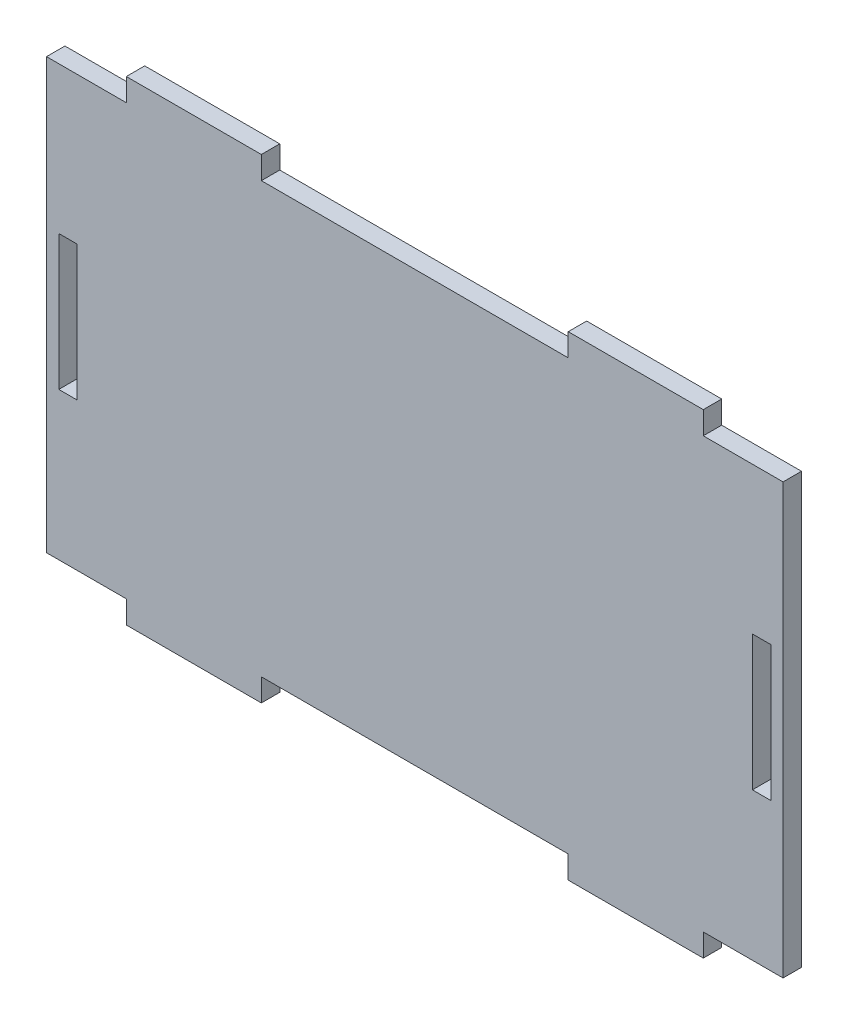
ISO-10303-21;
HEADER;
FILE_DESCRIPTION(('STEP AP214'),'2;1');
FILE_NAME('part.step','',(''),(''),'','','');
FILE_SCHEMA(('AUTOMOTIVE_DESIGN { 1 0 10303 214 1 1 1 1 }'));
ENDSEC;
DATA;
#1=APPLICATION_CONTEXT('core data for automotive mechanical design processes');
#2=APPLICATION_PROTOCOL_DEFINITION('international standard','automotive_design',2000,#1);
#3=PRODUCT_CONTEXT('',#1,'mechanical');
#4=PRODUCT('Part','Part','',(#3));
#5=PRODUCT_RELATED_PRODUCT_CATEGORY('part','',(#4));
#6=PRODUCT_DEFINITION_FORMATION('','',#4);
#7=PRODUCT_DEFINITION_CONTEXT('part definition',#1,'design');
#8=PRODUCT_DEFINITION('design','',#6,#7);
#9=PRODUCT_DEFINITION_SHAPE('','',#8);
#10=(LENGTH_UNIT() NAMED_UNIT(*) SI_UNIT(.MILLI.,.METRE.));
#11=(NAMED_UNIT(*) PLANE_ANGLE_UNIT() SI_UNIT($,.RADIAN.));
#12=(NAMED_UNIT(*) SI_UNIT($,.STERADIAN.) SOLID_ANGLE_UNIT());
#13=UNCERTAINTY_MEASURE_WITH_UNIT(LENGTH_MEASURE(1.E-05),#10,'distance_accuracy_value','');
#14=(GEOMETRIC_REPRESENTATION_CONTEXT(3) GLOBAL_UNCERTAINTY_ASSIGNED_CONTEXT((#13)) GLOBAL_UNIT_ASSIGNED_CONTEXT((#10,
#11,#12)) REPRESENTATION_CONTEXT('',''));
#15=CARTESIAN_POINT('',(0.,0.,0.));
#16=DIRECTION('',(0.,0.,1.));
#17=DIRECTION('',(1.,0.,0.));
#18=AXIS2_PLACEMENT_3D('',#15,#16,#17);
#19=CARTESIAN_POINT('',(118.,0.,3.));
#20=DIRECTION('',(1.,0.,0.));
#21=DIRECTION('',(0.,1.,0.));
#22=AXIS2_PLACEMENT_3D('',#19,#20,#21);
#23=PLANE('',#22);
#24=DIRECTION('',(0.,-1.,0.));
#25=VECTOR('',#24,1.);
#26=CARTESIAN_POINT('',(118.,0.,0.));
#27=LINE('',#26,#25);
#28=CARTESIAN_POINT('',(118.,46.0461461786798,0.));
#29=VERTEX_POINT('',#28);
#30=CARTESIAN_POINT('',(118.,24.0461461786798,0.));
#31=VERTEX_POINT('',#30);
#32=EDGE_CURVE('E318',#29,#31,#27,.T.);
#33=ORIENTED_EDGE('',*,*,#32,.T.);
#34=DIRECTION('',(0.,0.,-1.));
#35=VECTOR('',#34,1.);
#36=CARTESIAN_POINT('',(118.,24.0461461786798,3.));
#37=LINE('',#36,#35);
#38=CARTESIAN_POINT('',(118.,24.0461461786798,3.));
#39=VERTEX_POINT('',#38);
#40=EDGE_CURVE('E11',#39,#31,#37,.T.);
#41=ORIENTED_EDGE('',*,*,#40,.F.);
#42=DIRECTION('',(0.,-1.,0.));
#43=VECTOR('',#42,1.);
#44=CARTESIAN_POINT('',(118.,0.,3.));
#45=LINE('',#44,#43);
#46=CARTESIAN_POINT('',(118.,46.0461461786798,3.));
#47=VERTEX_POINT('',#46);
#48=EDGE_CURVE('E234',#47,#39,#45,.T.);
#49=ORIENTED_EDGE('',*,*,#48,.F.);
#50=DIRECTION('',(0.,0.,-1.));
#51=VECTOR('',#50,1.);
#52=CARTESIAN_POINT('',(118.,46.0461461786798,3.));
#53=LINE('',#52,#51);
#54=EDGE_CURVE('E54',#47,#29,#53,.T.);
#55=ORIENTED_EDGE('',*,*,#54,.T.);
#56=EDGE_LOOP('',(#33,#41,#49,#55));
#57=FACE_BOUND('',#56,.T.);
#58=ADVANCED_FACE('F35',(#57),#23,.F.);
#59=CARTESIAN_POINT('',(0.,24.0461461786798,3.));
#60=DIRECTION('',(0.,-1.,0.));
#61=DIRECTION('',(0.,0.,-1.));
#62=AXIS2_PLACEMENT_3D('',#59,#60,#61);
#63=PLANE('',#62);
#64=DIRECTION('',(-1.,0.,0.));
#65=VECTOR('',#64,1.);
#66=CARTESIAN_POINT('',(0.,24.0461461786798,0.));
#67=LINE('',#66,#65);
#68=CARTESIAN_POINT('',(115.,24.0461461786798,0.));
#69=VERTEX_POINT('',#68);
#70=EDGE_CURVE('E240',#31,#69,#67,.T.);
#71=ORIENTED_EDGE('',*,*,#70,.T.);
#72=DIRECTION('',(0.,0.,-1.));
#73=VECTOR('',#72,1.);
#74=CARTESIAN_POINT('',(115.,24.0461461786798,3.));
#75=LINE('',#74,#73);
#76=CARTESIAN_POINT('',(115.,24.0461461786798,3.));
#77=VERTEX_POINT('',#76);
#78=EDGE_CURVE('E45',#77,#69,#75,.T.);
#79=ORIENTED_EDGE('',*,*,#78,.F.);
#80=DIRECTION('',(-1.,0.,0.));
#81=VECTOR('',#80,1.);
#82=CARTESIAN_POINT('',(0.,24.0461461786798,3.));
#83=LINE('',#82,#81);
#84=EDGE_CURVE('E228',#39,#77,#83,.T.);
#85=ORIENTED_EDGE('',*,*,#84,.F.);
#86=ORIENTED_EDGE('',*,*,#40,.T.);
#87=EDGE_LOOP('',(#71,#79,#85,#86));
#88=FACE_BOUND('',#87,.T.);
#89=ADVANCED_FACE('F239',(#88),#63,.F.);
#90=CARTESIAN_POINT('',(115.,0.,3.));
#91=DIRECTION('',(1.,0.,0.));
#92=DIRECTION('',(0.,1.,0.));
#93=AXIS2_PLACEMENT_3D('',#90,#91,#92);
#94=PLANE('',#93);
#95=DIRECTION('',(0.,-1.,0.));
#96=VECTOR('',#95,1.);
#97=CARTESIAN_POINT('',(115.,0.,0.));
#98=LINE('',#97,#96);
#99=CARTESIAN_POINT('',(115.,46.0461461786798,0.));
#100=VERTEX_POINT('',#99);
#101=EDGE_CURVE('E321',#100,#69,#98,.T.);
#102=ORIENTED_EDGE('',*,*,#101,.F.);
#103=DIRECTION('',(0.,0.,-1.));
#104=VECTOR('',#103,1.);
#105=CARTESIAN_POINT('',(115.,46.0461461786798,3.));
#106=LINE('',#105,#104);
#107=CARTESIAN_POINT('',(115.,46.0461461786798,3.));
#108=VERTEX_POINT('',#107);
#109=EDGE_CURVE('E140',#108,#100,#106,.T.);
#110=ORIENTED_EDGE('',*,*,#109,.F.);
#111=DIRECTION('',(0.,-1.,0.));
#112=VECTOR('',#111,1.);
#113=CARTESIAN_POINT('',(115.,0.,3.));
#114=LINE('',#113,#112);
#115=EDGE_CURVE('E233',#108,#77,#114,.T.);
#116=ORIENTED_EDGE('',*,*,#115,.T.);
#117=ORIENTED_EDGE('',*,*,#78,.T.);
#118=EDGE_LOOP('',(#102,#110,#116,#117));
#119=FACE_BOUND('',#118,.T.);
#120=ADVANCED_FACE('F244',(#119),#94,.T.);
#121=CARTESIAN_POINT('',(0.,46.0461461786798,3.));
#122=DIRECTION('',(0.,1.,0.));
#123=DIRECTION('',(0.,0.,1.));
#124=AXIS2_PLACEMENT_3D('',#121,#122,#123);
#125=PLANE('',#124);
#126=DIRECTION('',(1.,0.,0.));
#127=VECTOR('',#126,1.);
#128=CARTESIAN_POINT('',(0.,46.0461461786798,0.));
#129=LINE('',#128,#127);
#130=CARTESIAN_POINT('',(2.,46.0461461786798,0.));
#131=VERTEX_POINT('',#130);
#132=CARTESIAN_POINT('',(5.,46.0461461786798,0.));
#133=VERTEX_POINT('',#132);
#134=EDGE_CURVE('E306',#131,#133,#129,.T.);
#135=ORIENTED_EDGE('',*,*,#134,.T.);
#136=DIRECTION('',(0.,0.,-1.));
#137=VECTOR('',#136,1.);
#138=CARTESIAN_POINT('',(5.,46.0461461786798,3.));
#139=LINE('',#138,#137);
#140=CARTESIAN_POINT('',(5.,46.0461461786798,3.));
#141=VERTEX_POINT('',#140);
#142=EDGE_CURVE('E328',#141,#133,#139,.T.);
#143=ORIENTED_EDGE('',*,*,#142,.F.);
#144=DIRECTION('',(1.,0.,0.));
#145=VECTOR('',#144,1.);
#146=CARTESIAN_POINT('',(0.,46.0461461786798,3.));
#147=LINE('',#146,#145);
#148=CARTESIAN_POINT('',(2.,46.0461461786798,3.));
#149=VERTEX_POINT('',#148);
#150=EDGE_CURVE('E748',#149,#141,#147,.T.);
#151=ORIENTED_EDGE('',*,*,#150,.F.);
#152=DIRECTION('',(0.,0.,-1.));
#153=VECTOR('',#152,1.);
#154=CARTESIAN_POINT('',(2.,46.0461461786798,3.));
#155=LINE('',#154,#153);
#156=EDGE_CURVE('E330',#149,#131,#155,.T.);
#157=ORIENTED_EDGE('',*,*,#156,.T.);
#158=EDGE_LOOP('',(#135,#143,#151,#157));
#159=FACE_BOUND('',#158,.T.);
#160=ADVANCED_FACE('F516',(#159),#125,.F.);
#161=CARTESIAN_POINT('',(5.,0.,3.));
#162=DIRECTION('',(1.,0.,0.));
#163=DIRECTION('',(0.,1.,0.));
#164=AXIS2_PLACEMENT_3D('',#161,#162,#163);
#165=PLANE('',#164);
#166=DIRECTION('',(0.,-1.,0.));
#167=VECTOR('',#166,1.);
#168=CARTESIAN_POINT('',(5.,0.,0.));
#169=LINE('',#168,#167);
#170=CARTESIAN_POINT('',(5.,24.0461461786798,0.));
#171=VERTEX_POINT('',#170);
#172=EDGE_CURVE('E309',#133,#171,#169,.T.);
#173=ORIENTED_EDGE('',*,*,#172,.T.);
#174=DIRECTION('',(0.,0.,-1.));
#175=VECTOR('',#174,1.);
#176=CARTESIAN_POINT('',(5.,24.0461461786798,3.));
#177=LINE('',#176,#175);
#178=CARTESIAN_POINT('',(5.,24.0461461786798,3.));
#179=VERTEX_POINT('',#178);
#180=EDGE_CURVE('E334',#179,#171,#177,.T.);
#181=ORIENTED_EDGE('',*,*,#180,.F.);
#182=DIRECTION('',(0.,-1.,0.));
#183=VECTOR('',#182,1.);
#184=CARTESIAN_POINT('',(5.,0.,3.));
#185=LINE('',#184,#183);
#186=EDGE_CURVE('E751',#141,#179,#185,.T.);
#187=ORIENTED_EDGE('',*,*,#186,.F.);
#188=ORIENTED_EDGE('',*,*,#142,.T.);
#189=EDGE_LOOP('',(#173,#181,#187,#188));
#190=FACE_BOUND('',#189,.T.);
#191=ADVANCED_FACE('F512',(#190),#165,.F.);
#192=CARTESIAN_POINT('',(0.,24.0461461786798,3.));
#193=DIRECTION('',(0.,1.,0.));
#194=DIRECTION('',(0.,0.,1.));
#195=AXIS2_PLACEMENT_3D('',#192,#193,#194);
#196=PLANE('',#195);
#197=DIRECTION('',(1.,0.,0.));
#198=VECTOR('',#197,1.);
#199=CARTESIAN_POINT('',(0.,24.0461461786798,0.));
#200=LINE('',#199,#198);
#201=CARTESIAN_POINT('',(2.,24.0461461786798,0.));
#202=VERTEX_POINT('',#201);
#203=EDGE_CURVE('E312',#202,#171,#200,.T.);
#204=ORIENTED_EDGE('',*,*,#203,.F.);
#205=DIRECTION('',(0.,0.,-1.));
#206=VECTOR('',#205,1.);
#207=CARTESIAN_POINT('',(2.,24.0461461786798,3.));
#208=LINE('',#207,#206);
#209=CARTESIAN_POINT('',(2.,24.0461461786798,3.));
#210=VERTEX_POINT('',#209);
#211=EDGE_CURVE('E332',#210,#202,#208,.T.);
#212=ORIENTED_EDGE('',*,*,#211,.F.);
#213=DIRECTION('',(1.,0.,0.));
#214=VECTOR('',#213,1.);
#215=CARTESIAN_POINT('',(0.,24.0461461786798,3.));
#216=LINE('',#215,#214);
#217=EDGE_CURVE('E759',#210,#179,#216,.T.);
#218=ORIENTED_EDGE('',*,*,#217,.T.);
#219=ORIENTED_EDGE('',*,*,#180,.T.);
#220=EDGE_LOOP('',(#204,#212,#218,#219));
#221=FACE_BOUND('',#220,.T.);
#222=ADVANCED_FACE('F509',(#221),#196,.T.);
#223=CARTESIAN_POINT('',(0.,70.,3.));
#224=DIRECTION('',(0.,1.,0.));
#225=DIRECTION('',(0.,0.,1.));
#226=AXIS2_PLACEMENT_3D('',#223,#224,#225);
#227=PLANE('',#226);
#228=DIRECTION('',(1.,0.,0.));
#229=VECTOR('',#228,1.);
#230=CARTESIAN_POINT('',(0.,70.,0.));
#231=LINE('',#230,#229);
#232=CARTESIAN_POINT('',(107.,70.,0.));
#233=VERTEX_POINT('',#232);
#234=CARTESIAN_POINT('',(120.,70.,0.));
#235=VERTEX_POINT('',#234);
#236=EDGE_CURVE('E251',#233,#235,#231,.T.);
#237=ORIENTED_EDGE('',*,*,#236,.F.);
#238=DIRECTION('',(0.,0.,-1.));
#239=VECTOR('',#238,1.);
#240=CARTESIAN_POINT('',(107.,70.,3.));
#241=LINE('',#240,#239);
#242=CARTESIAN_POINT('',(107.,70.,3.));
#243=VERTEX_POINT('',#242);
#244=EDGE_CURVE('E39',#243,#233,#241,.T.);
#245=ORIENTED_EDGE('',*,*,#244,.F.);
#246=DIRECTION('',(1.,0.,0.));
#247=VECTOR('',#246,1.);
#248=CARTESIAN_POINT('',(0.,70.,3.));
#249=LINE('',#248,#247);
#250=CARTESIAN_POINT('',(120.,70.,3.));
#251=VERTEX_POINT('',#250);
#252=EDGE_CURVE('E326',#243,#251,#249,.T.);
#253=ORIENTED_EDGE('',*,*,#252,.T.);
#254=DIRECTION('',(0.,0.,-1.));
#255=VECTOR('',#254,1.);
#256=CARTESIAN_POINT('',(120.,70.,3.));
#257=LINE('',#256,#255);
#258=EDGE_CURVE('E247',#251,#235,#257,.T.);
#259=ORIENTED_EDGE('',*,*,#258,.T.);
#260=EDGE_LOOP('',(#237,#245,#253,#259));
#261=FACE_BOUND('',#260,.T.);
#262=ADVANCED_FACE('F37',(#261),#227,.T.);
#263=CARTESIAN_POINT('',(107.,0.,3.));
#264=DIRECTION('',(-1.,0.,0.));
#265=DIRECTION('',(0.,0.,1.));
#266=AXIS2_PLACEMENT_3D('',#263,#264,#265);
#267=PLANE('',#266);
#268=DIRECTION('',(0.,1.,0.));
#269=VECTOR('',#268,1.);
#270=CARTESIAN_POINT('',(107.,0.,0.));
#271=LINE('',#270,#269);
#272=CARTESIAN_POINT('',(107.,73.6959879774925,0.));
#273=VERTEX_POINT('',#272);
#274=EDGE_CURVE('E254',#233,#273,#271,.T.);
#275=ORIENTED_EDGE('',*,*,#274,.T.);
#276=DIRECTION('',(0.,0.,-1.));
#277=VECTOR('',#276,1.);
#278=CARTESIAN_POINT('',(107.,73.6959879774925,3.));
#279=LINE('',#278,#277);
#280=CARTESIAN_POINT('',(107.,73.6959879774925,3.));
#281=VERTEX_POINT('',#280);
#282=EDGE_CURVE('E377',#281,#273,#279,.T.);
#283=ORIENTED_EDGE('',*,*,#282,.F.);
#284=DIRECTION('',(0.,1.,0.));
#285=VECTOR('',#284,1.);
#286=CARTESIAN_POINT('',(107.,0.,3.));
#287=LINE('',#286,#285);
#288=EDGE_CURVE('E385',#243,#281,#287,.T.);
#289=ORIENTED_EDGE('',*,*,#288,.F.);
#290=ORIENTED_EDGE('',*,*,#244,.T.);
#291=EDGE_LOOP('',(#275,#283,#289,#290));
#292=FACE_BOUND('',#291,.T.);
#293=ADVANCED_FACE('F384',(#292),#267,.F.);
#294=CARTESIAN_POINT('',(0.,73.6959879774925,3.));
#295=DIRECTION('',(0.,1.,0.));
#296=DIRECTION('',(0.,0.,1.));
#297=AXIS2_PLACEMENT_3D('',#294,#295,#296);
#298=PLANE('',#297);
#299=DIRECTION('',(1.,0.,0.));
#300=VECTOR('',#299,1.);
#301=CARTESIAN_POINT('',(0.,73.6959879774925,0.));
#302=LINE('',#301,#300);
#303=CARTESIAN_POINT('',(85.,73.6959879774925,0.));
#304=VERTEX_POINT('',#303);
#305=EDGE_CURVE('E257',#304,#273,#302,.T.);
#306=ORIENTED_EDGE('',*,*,#305,.F.);
#307=DIRECTION('',(0.,0.,-1.));
#308=VECTOR('',#307,1.);
#309=CARTESIAN_POINT('',(85.,73.6959879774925,3.));
#310=LINE('',#309,#308);
#311=CARTESIAN_POINT('',(85.,73.6959879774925,3.));
#312=VERTEX_POINT('',#311);
#313=EDGE_CURVE('E376',#312,#304,#310,.T.);
#314=ORIENTED_EDGE('',*,*,#313,.F.);
#315=DIRECTION('',(1.,0.,0.));
#316=VECTOR('',#315,1.);
#317=CARTESIAN_POINT('',(0.,73.6959879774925,3.));
#318=LINE('',#317,#316);
#319=EDGE_CURVE('E787',#312,#281,#318,.T.);
#320=ORIENTED_EDGE('',*,*,#319,.T.);
#321=ORIENTED_EDGE('',*,*,#282,.T.);
#322=EDGE_LOOP('',(#306,#314,#320,#321));
#323=FACE_BOUND('',#322,.T.);
#324=ADVANCED_FACE('F488',(#323),#298,.T.);
#325=CARTESIAN_POINT('',(85.,0.,3.));
#326=DIRECTION('',(-1.,0.,0.));
#327=DIRECTION('',(0.,0.,1.));
#328=AXIS2_PLACEMENT_3D('',#325,#326,#327);
#329=PLANE('',#328);
#330=DIRECTION('',(0.,1.,0.));
#331=VECTOR('',#330,1.);
#332=CARTESIAN_POINT('',(85.,0.,0.));
#333=LINE('',#332,#331);
#334=CARTESIAN_POINT('',(85.,70.,0.));
#335=VERTEX_POINT('',#334);
#336=EDGE_CURVE('E260',#335,#304,#333,.T.);
#337=ORIENTED_EDGE('',*,*,#336,.F.);
#338=DIRECTION('',(0.,0.,-1.));
#339=VECTOR('',#338,1.);
#340=CARTESIAN_POINT('',(85.,70.,3.));
#341=LINE('',#340,#339);
#342=CARTESIAN_POINT('',(85.,70.,3.));
#343=VERTEX_POINT('',#342);
#344=EDGE_CURVE('E374',#343,#335,#341,.T.);
#345=ORIENTED_EDGE('',*,*,#344,.F.);
#346=DIRECTION('',(0.,1.,0.));
#347=VECTOR('',#346,1.);
#348=CARTESIAN_POINT('',(85.,0.,3.));
#349=LINE('',#348,#347);
#350=EDGE_CURVE('E486',#343,#312,#349,.T.);
#351=ORIENTED_EDGE('',*,*,#350,.T.);
#352=ORIENTED_EDGE('',*,*,#313,.T.);
#353=EDGE_LOOP('',(#337,#345,#351,#352));
#354=FACE_BOUND('',#353,.T.);
#355=ADVANCED_FACE('F485',(#354),#329,.T.);
#356=CARTESIAN_POINT('',(0.,70.,3.));
#357=DIRECTION('',(0.,1.,0.));
#358=DIRECTION('',(0.,0.,1.));
#359=AXIS2_PLACEMENT_3D('',#356,#357,#358);
#360=PLANE('',#359);
#361=DIRECTION('',(1.,0.,0.));
#362=VECTOR('',#361,1.);
#363=CARTESIAN_POINT('',(0.,70.,0.));
#364=LINE('',#363,#362);
#365=CARTESIAN_POINT('',(35.,70.,0.));
#366=VERTEX_POINT('',#365);
#367=EDGE_CURVE('E263',#366,#335,#364,.T.);
#368=ORIENTED_EDGE('',*,*,#367,.F.);
#369=DIRECTION('',(0.,0.,-1.));
#370=VECTOR('',#369,1.);
#371=CARTESIAN_POINT('',(35.,70.,3.));
#372=LINE('',#371,#370);
#373=CARTESIAN_POINT('',(35.,70.,3.));
#374=VERTEX_POINT('',#373);
#375=EDGE_CURVE('E372',#374,#366,#372,.T.);
#376=ORIENTED_EDGE('',*,*,#375,.F.);
#377=DIRECTION('',(1.,0.,0.));
#378=VECTOR('',#377,1.);
#379=CARTESIAN_POINT('',(0.,70.,3.));
#380=LINE('',#379,#378);
#381=EDGE_CURVE('E481',#374,#343,#380,.T.);
#382=ORIENTED_EDGE('',*,*,#381,.T.);
#383=ORIENTED_EDGE('',*,*,#344,.T.);
#384=EDGE_LOOP('',(#368,#376,#382,#383));
#385=FACE_BOUND('',#384,.T.);
#386=ADVANCED_FACE('F478',(#385),#360,.T.);
#387=CARTESIAN_POINT('',(35.,0.,3.));
#388=DIRECTION('',(-1.,0.,0.));
#389=DIRECTION('',(0.,0.,1.));
#390=AXIS2_PLACEMENT_3D('',#387,#388,#389);
#391=PLANE('',#390);
#392=DIRECTION('',(0.,1.,0.));
#393=VECTOR('',#392,1.);
#394=CARTESIAN_POINT('',(35.,0.,0.));
#395=LINE('',#394,#393);
#396=CARTESIAN_POINT('',(35.,73.6959879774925,0.));
#397=VERTEX_POINT('',#396);
#398=EDGE_CURVE('E266',#366,#397,#395,.T.);
#399=ORIENTED_EDGE('',*,*,#398,.T.);
#400=DIRECTION('',(0.,0.,-1.));
#401=VECTOR('',#400,1.);
#402=CARTESIAN_POINT('',(35.,73.6959879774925,3.));
#403=LINE('',#402,#401);
#404=CARTESIAN_POINT('',(35.,73.6959879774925,3.));
#405=VERTEX_POINT('',#404);
#406=EDGE_CURVE('E369',#405,#397,#403,.T.);
#407=ORIENTED_EDGE('',*,*,#406,.F.);
#408=DIRECTION('',(0.,1.,0.));
#409=VECTOR('',#408,1.);
#410=CARTESIAN_POINT('',(35.,0.,3.));
#411=LINE('',#410,#409);
#412=EDGE_CURVE('E474',#374,#405,#411,.T.);
#413=ORIENTED_EDGE('',*,*,#412,.F.);
#414=ORIENTED_EDGE('',*,*,#375,.T.);
#415=EDGE_LOOP('',(#399,#407,#413,#414));
#416=FACE_BOUND('',#415,.T.);
#417=ADVANCED_FACE('F473',(#416),#391,.F.);
#418=CARTESIAN_POINT('',(0.,73.6959879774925,3.));
#419=DIRECTION('',(0.,-1.,0.));
#420=DIRECTION('',(0.,0.,-1.));
#421=AXIS2_PLACEMENT_3D('',#418,#419,#420);
#422=PLANE('',#421);
#423=DIRECTION('',(-1.,0.,0.));
#424=VECTOR('',#423,1.);
#425=CARTESIAN_POINT('',(0.,73.6959879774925,0.));
#426=LINE('',#425,#424);
#427=CARTESIAN_POINT('',(13.,73.6959879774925,0.));
#428=VERTEX_POINT('',#427);
#429=EDGE_CURVE('E268',#397,#428,#426,.T.);
#430=ORIENTED_EDGE('',*,*,#429,.T.);
#431=DIRECTION('',(0.,0.,-1.));
#432=VECTOR('',#431,1.);
#433=CARTESIAN_POINT('',(13.,73.6959879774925,3.));
#434=LINE('',#433,#432);
#435=CARTESIAN_POINT('',(13.,73.6959879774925,3.));
#436=VERTEX_POINT('',#435);
#437=EDGE_CURVE('E367',#436,#428,#434,.T.);
#438=ORIENTED_EDGE('',*,*,#437,.F.);
#439=DIRECTION('',(-1.,0.,0.));
#440=VECTOR('',#439,1.);
#441=CARTESIAN_POINT('',(0.,73.6959879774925,3.));
#442=LINE('',#441,#440);
#443=EDGE_CURVE('E470',#405,#436,#442,.T.);
#444=ORIENTED_EDGE('',*,*,#443,.F.);
#445=ORIENTED_EDGE('',*,*,#406,.T.);
#446=EDGE_LOOP('',(#430,#438,#444,#445));
#447=FACE_BOUND('',#446,.T.);
#448=ADVANCED_FACE('F468',(#447),#422,.F.);
#449=CARTESIAN_POINT('',(13.,0.,3.));
#450=DIRECTION('',(-1.,0.,0.));
#451=DIRECTION('',(0.,0.,1.));
#452=AXIS2_PLACEMENT_3D('',#449,#450,#451);
#453=PLANE('',#452);
#454=DIRECTION('',(0.,1.,0.));
#455=VECTOR('',#454,1.);
#456=CARTESIAN_POINT('',(13.,0.,0.));
#457=LINE('',#456,#455);
#458=CARTESIAN_POINT('',(13.,70.,0.));
#459=VERTEX_POINT('',#458);
#460=EDGE_CURVE('E271',#459,#428,#457,.T.);
#461=ORIENTED_EDGE('',*,*,#460,.F.);
#462=DIRECTION('',(0.,0.,-1.));
#463=VECTOR('',#462,1.);
#464=CARTESIAN_POINT('',(13.,70.,3.));
#465=LINE('',#464,#463);
#466=CARTESIAN_POINT('',(13.,70.,3.));
#467=VERTEX_POINT('',#466);
#468=EDGE_CURVE('E365',#467,#459,#465,.T.);
#469=ORIENTED_EDGE('',*,*,#468,.F.);
#470=DIRECTION('',(0.,1.,0.));
#471=VECTOR('',#470,1.);
#472=CARTESIAN_POINT('',(13.,0.,3.));
#473=LINE('',#472,#471);
#474=EDGE_CURVE('E465',#467,#436,#473,.T.);
#475=ORIENTED_EDGE('',*,*,#474,.T.);
#476=ORIENTED_EDGE('',*,*,#437,.T.);
#477=EDGE_LOOP('',(#461,#469,#475,#476));
#478=FACE_BOUND('',#477,.T.);
#479=ADVANCED_FACE('F461',(#478),#453,.T.);
#480=CARTESIAN_POINT('',(0.,70.,3.));
#481=DIRECTION('',(0.,1.,0.));
#482=DIRECTION('',(0.,0.,1.));
#483=AXIS2_PLACEMENT_3D('',#480,#481,#482);
#484=PLANE('',#483);
#485=DIRECTION('',(1.,0.,0.));
#486=VECTOR('',#485,1.);
#487=CARTESIAN_POINT('',(0.,70.,0.));
#488=LINE('',#487,#486);
#489=CARTESIAN_POINT('',(0.,70.,0.));
#490=VERTEX_POINT('',#489);
#491=EDGE_CURVE('E274',#490,#459,#488,.T.);
#492=ORIENTED_EDGE('',*,*,#491,.F.);
#493=DIRECTION('',(0.,0.,-1.));
#494=VECTOR('',#493,1.);
#495=CARTESIAN_POINT('',(0.,70.,3.));
#496=LINE('',#495,#494);
#497=CARTESIAN_POINT('',(0.,70.,3.));
#498=VERTEX_POINT('',#497);
#499=EDGE_CURVE('E363',#498,#490,#496,.T.);
#500=ORIENTED_EDGE('',*,*,#499,.F.);
#501=DIRECTION('',(1.,0.,0.));
#502=VECTOR('',#501,1.);
#503=CARTESIAN_POINT('',(0.,70.,3.));
#504=LINE('',#503,#502);
#505=EDGE_CURVE('E780',#498,#467,#504,.T.);
#506=ORIENTED_EDGE('',*,*,#505,.T.);
#507=ORIENTED_EDGE('',*,*,#468,.T.);
#508=EDGE_LOOP('',(#492,#500,#506,#507));
#509=FACE_BOUND('',#508,.T.);
#510=ADVANCED_FACE('F456',(#509),#484,.T.);
#511=CARTESIAN_POINT('',(0.,0.,3.));
#512=DIRECTION('',(-1.,0.,0.));
#513=DIRECTION('',(0.,0.,1.));
#514=AXIS2_PLACEMENT_3D('',#511,#512,#513);
#515=PLANE('',#514);
#516=DIRECTION('',(0.,1.,0.));
#517=VECTOR('',#516,1.);
#518=CARTESIAN_POINT('',(0.,0.,0.));
#519=LINE('',#518,#517);
#520=CARTESIAN_POINT('',(0.,0.,0.));
#521=VERTEX_POINT('',#520);
#522=EDGE_CURVE('E277',#521,#490,#519,.T.);
#523=ORIENTED_EDGE('',*,*,#522,.F.);
#524=DIRECTION('',(0.,0.,-1.));
#525=VECTOR('',#524,1.);
#526=CARTESIAN_POINT('',(0.,0.,3.));
#527=LINE('',#526,#525);
#528=CARTESIAN_POINT('',(0.,0.,3.));
#529=VERTEX_POINT('',#528);
#530=EDGE_CURVE('E361',#529,#521,#527,.T.);
#531=ORIENTED_EDGE('',*,*,#530,.F.);
#532=DIRECTION('',(0.,1.,0.));
#533=VECTOR('',#532,1.);
#534=CARTESIAN_POINT('',(0.,0.,3.));
#535=LINE('',#534,#533);
#536=EDGE_CURVE('E452',#529,#498,#535,.T.);
#537=ORIENTED_EDGE('',*,*,#536,.T.);
#538=ORIENTED_EDGE('',*,*,#499,.T.);
#539=EDGE_LOOP('',(#523,#531,#537,#538));
#540=FACE_BOUND('',#539,.T.);
#541=ADVANCED_FACE('F449',(#540),#515,.T.);
#542=CARTESIAN_POINT('',(0.,0.,3.));
#543=DIRECTION('',(0.,1.,0.));
#544=DIRECTION('',(0.,0.,1.));
#545=AXIS2_PLACEMENT_3D('',#542,#543,#544);
#546=PLANE('',#545);
#547=DIRECTION('',(1.,0.,0.));
#548=VECTOR('',#547,1.);
#549=CARTESIAN_POINT('',(0.,0.,0.));
#550=LINE('',#549,#548);
#551=CARTESIAN_POINT('',(13.,0.,0.));
#552=VERTEX_POINT('',#551);
#553=EDGE_CURVE('E280',#521,#552,#550,.T.);
#554=ORIENTED_EDGE('',*,*,#553,.T.);
#555=DIRECTION('',(0.,0.,-1.));
#556=VECTOR('',#555,1.);
#557=CARTESIAN_POINT('',(13.,0.,3.));
#558=LINE('',#557,#556);
#559=CARTESIAN_POINT('',(13.,0.,3.));
#560=VERTEX_POINT('',#559);
#561=EDGE_CURVE('E358',#560,#552,#558,.T.);
#562=ORIENTED_EDGE('',*,*,#561,.F.);
#563=DIRECTION('',(1.,0.,0.));
#564=VECTOR('',#563,1.);
#565=CARTESIAN_POINT('',(0.,0.,3.));
#566=LINE('',#565,#564);
#567=EDGE_CURVE('E445',#529,#560,#566,.T.);
#568=ORIENTED_EDGE('',*,*,#567,.F.);
#569=ORIENTED_EDGE('',*,*,#530,.T.);
#570=EDGE_LOOP('',(#554,#562,#568,#569));
#571=FACE_BOUND('',#570,.T.);
#572=ADVANCED_FACE('F444',(#571),#546,.F.);
#573=CARTESIAN_POINT('',(13.,0.,3.));
#574=DIRECTION('',(1.,0.,0.));
#575=DIRECTION('',(0.,0.,-1.));
#576=AXIS2_PLACEMENT_3D('',#573,#574,#575);
#577=PLANE('',#576);
#578=DIRECTION('',(0.,-1.,0.));
#579=VECTOR('',#578,1.);
#580=CARTESIAN_POINT('',(13.,0.,0.));
#581=LINE('',#580,#579);
#582=CARTESIAN_POINT('',(13.,-3.69598797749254,0.));
#583=VERTEX_POINT('',#582);
#584=EDGE_CURVE('E282',#552,#583,#581,.T.);
#585=ORIENTED_EDGE('',*,*,#584,.T.);
#586=DIRECTION('',(0.,0.,-1.));
#587=VECTOR('',#586,1.);
#588=CARTESIAN_POINT('',(13.,-3.69598797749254,3.));
#589=LINE('',#588,#587);
#590=CARTESIAN_POINT('',(13.,-3.69598797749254,3.));
#591=VERTEX_POINT('',#590);
#592=EDGE_CURVE('E356',#591,#583,#589,.T.);
#593=ORIENTED_EDGE('',*,*,#592,.F.);
#594=DIRECTION('',(0.,-1.,0.));
#595=VECTOR('',#594,1.);
#596=CARTESIAN_POINT('',(13.,0.,3.));
#597=LINE('',#596,#595);
#598=EDGE_CURVE('E441',#560,#591,#597,.T.);
#599=ORIENTED_EDGE('',*,*,#598,.F.);
#600=ORIENTED_EDGE('',*,*,#561,.T.);
#601=EDGE_LOOP('',(#585,#593,#599,#600));
#602=FACE_BOUND('',#601,.T.);
#603=ADVANCED_FACE('F439',(#602),#577,.F.);
#604=CARTESIAN_POINT('',(0.,-3.69598797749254,3.));
#605=DIRECTION('',(0.,-1.,0.));
#606=DIRECTION('',(0.,0.,-1.));
#607=AXIS2_PLACEMENT_3D('',#604,#605,#606);
#608=PLANE('',#607);
#609=DIRECTION('',(-1.,0.,0.));
#610=VECTOR('',#609,1.);
#611=CARTESIAN_POINT('',(0.,-3.69598797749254,0.));
#612=LINE('',#611,#610);
#613=CARTESIAN_POINT('',(35.,-3.69598797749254,0.));
#614=VERTEX_POINT('',#613);
#615=EDGE_CURVE('E285',#614,#583,#612,.T.);
#616=ORIENTED_EDGE('',*,*,#615,.F.);
#617=DIRECTION('',(0.,0.,-1.));
#618=VECTOR('',#617,1.);
#619=CARTESIAN_POINT('',(35.,-3.69598797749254,3.));
#620=LINE('',#619,#618);
#621=CARTESIAN_POINT('',(35.,-3.69598797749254,3.));
#622=VERTEX_POINT('',#621);
#623=EDGE_CURVE('E354',#622,#614,#620,.T.);
#624=ORIENTED_EDGE('',*,*,#623,.F.);
#625=DIRECTION('',(-1.,0.,0.));
#626=VECTOR('',#625,1.);
#627=CARTESIAN_POINT('',(0.,-3.69598797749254,3.));
#628=LINE('',#627,#626);
#629=EDGE_CURVE('E436',#622,#591,#628,.T.);
#630=ORIENTED_EDGE('',*,*,#629,.T.);
#631=ORIENTED_EDGE('',*,*,#592,.T.);
#632=EDGE_LOOP('',(#616,#624,#630,#631));
#633=FACE_BOUND('',#632,.T.);
#634=ADVANCED_FACE('F432',(#633),#608,.T.);
#635=CARTESIAN_POINT('',(35.,0.,3.));
#636=DIRECTION('',(1.,0.,0.));
#637=DIRECTION('',(0.,0.,-1.));
#638=AXIS2_PLACEMENT_3D('',#635,#636,#637);
#639=PLANE('',#638);
#640=DIRECTION('',(0.,-1.,0.));
#641=VECTOR('',#640,1.);
#642=CARTESIAN_POINT('',(35.,0.,0.));
#643=LINE('',#642,#641);
#644=CARTESIAN_POINT('',(35.,0.,0.));
#645=VERTEX_POINT('',#644);
#646=EDGE_CURVE('E288',#645,#614,#643,.T.);
#647=ORIENTED_EDGE('',*,*,#646,.F.);
#648=DIRECTION('',(0.,0.,-1.));
#649=VECTOR('',#648,1.);
#650=CARTESIAN_POINT('',(35.,0.,3.));
#651=LINE('',#650,#649);
#652=CARTESIAN_POINT('',(35.,0.,3.));
#653=VERTEX_POINT('',#652);
#654=EDGE_CURVE('E352',#653,#645,#651,.T.);
#655=ORIENTED_EDGE('',*,*,#654,.F.);
#656=DIRECTION('',(0.,-1.,0.));
#657=VECTOR('',#656,1.);
#658=CARTESIAN_POINT('',(35.,0.,3.));
#659=LINE('',#658,#657);
#660=EDGE_CURVE('E427',#653,#622,#659,.T.);
#661=ORIENTED_EDGE('',*,*,#660,.T.);
#662=ORIENTED_EDGE('',*,*,#623,.T.);
#663=EDGE_LOOP('',(#647,#655,#661,#662));
#664=FACE_BOUND('',#663,.T.);
#665=ADVANCED_FACE('F426',(#664),#639,.T.);
#666=CARTESIAN_POINT('',(0.,0.,3.));
#667=DIRECTION('',(0.,1.,0.));
#668=DIRECTION('',(0.,0.,1.));
#669=AXIS2_PLACEMENT_3D('',#666,#667,#668);
#670=PLANE('',#669);
#671=DIRECTION('',(1.,0.,0.));
#672=VECTOR('',#671,1.);
#673=CARTESIAN_POINT('',(0.,0.,0.));
#674=LINE('',#673,#672);
#675=CARTESIAN_POINT('',(85.,0.,0.));
#676=VERTEX_POINT('',#675);
#677=EDGE_CURVE('E291',#645,#676,#674,.T.);
#678=ORIENTED_EDGE('',*,*,#677,.T.);
#679=DIRECTION('',(0.,0.,-1.));
#680=VECTOR('',#679,1.);
#681=CARTESIAN_POINT('',(85.,0.,3.));
#682=LINE('',#681,#680);
#683=CARTESIAN_POINT('',(85.,0.,3.));
#684=VERTEX_POINT('',#683);
#685=EDGE_CURVE('E349',#684,#676,#682,.T.);
#686=ORIENTED_EDGE('',*,*,#685,.F.);
#687=DIRECTION('',(1.,0.,0.));
#688=VECTOR('',#687,1.);
#689=CARTESIAN_POINT('',(0.,0.,3.));
#690=LINE('',#689,#688);
#691=EDGE_CURVE('E422',#653,#684,#690,.T.);
#692=ORIENTED_EDGE('',*,*,#691,.F.);
#693=ORIENTED_EDGE('',*,*,#654,.T.);
#694=EDGE_LOOP('',(#678,#686,#692,#693));
#695=FACE_BOUND('',#694,.T.);
#696=ADVANCED_FACE('F421',(#695),#670,.F.);
#697=CARTESIAN_POINT('',(85.,0.,3.));
#698=DIRECTION('',(1.,0.,0.));
#699=DIRECTION('',(0.,0.,-1.));
#700=AXIS2_PLACEMENT_3D('',#697,#698,#699);
#701=PLANE('',#700);
#702=DIRECTION('',(0.,-1.,0.));
#703=VECTOR('',#702,1.);
#704=CARTESIAN_POINT('',(85.,0.,0.));
#705=LINE('',#704,#703);
#706=CARTESIAN_POINT('',(85.,-3.69598797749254,0.));
#707=VERTEX_POINT('',#706);
#708=EDGE_CURVE('E293',#676,#707,#705,.T.);
#709=ORIENTED_EDGE('',*,*,#708,.T.);
#710=DIRECTION('',(0.,0.,-1.));
#711=VECTOR('',#710,1.);
#712=CARTESIAN_POINT('',(85.,-3.69598797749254,3.));
#713=LINE('',#712,#711);
#714=CARTESIAN_POINT('',(85.,-3.69598797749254,3.));
#715=VERTEX_POINT('',#714);
#716=EDGE_CURVE('E346',#715,#707,#713,.T.);
#717=ORIENTED_EDGE('',*,*,#716,.F.);
#718=DIRECTION('',(0.,-1.,0.));
#719=VECTOR('',#718,1.);
#720=CARTESIAN_POINT('',(85.,0.,3.));
#721=LINE('',#720,#719);
#722=EDGE_CURVE('E418',#684,#715,#721,.T.);
#723=ORIENTED_EDGE('',*,*,#722,.F.);
#724=ORIENTED_EDGE('',*,*,#685,.T.);
#725=EDGE_LOOP('',(#709,#717,#723,#724));
#726=FACE_BOUND('',#725,.T.);
#727=ADVANCED_FACE('F415',(#726),#701,.F.);
#728=CARTESIAN_POINT('',(0.,-3.69598797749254,3.));
#729=DIRECTION('',(0.,1.,0.));
#730=DIRECTION('',(0.,0.,1.));
#731=AXIS2_PLACEMENT_3D('',#728,#729,#730);
#732=PLANE('',#731);
#733=DIRECTION('',(1.,0.,0.));
#734=VECTOR('',#733,1.);
#735=CARTESIAN_POINT('',(0.,-3.69598797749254,0.));
#736=LINE('',#735,#734);
#737=CARTESIAN_POINT('',(107.,-3.69598797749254,0.));
#738=VERTEX_POINT('',#737);
#739=EDGE_CURVE('E295',#707,#738,#736,.T.);
#740=ORIENTED_EDGE('',*,*,#739,.T.);
#741=DIRECTION('',(0.,0.,-1.));
#742=VECTOR('',#741,1.);
#743=CARTESIAN_POINT('',(107.,-3.69598797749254,3.));
#744=LINE('',#743,#742);
#745=CARTESIAN_POINT('',(107.,-3.69598797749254,3.));
#746=VERTEX_POINT('',#745);
#747=EDGE_CURVE('E344',#746,#738,#744,.T.);
#748=ORIENTED_EDGE('',*,*,#747,.F.);
#749=DIRECTION('',(1.,0.,0.));
#750=VECTOR('',#749,1.);
#751=CARTESIAN_POINT('',(0.,-3.69598797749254,3.));
#752=LINE('',#751,#750);
#753=EDGE_CURVE('E771',#715,#746,#752,.T.);
#754=ORIENTED_EDGE('',*,*,#753,.F.);
#755=ORIENTED_EDGE('',*,*,#716,.T.);
#756=EDGE_LOOP('',(#740,#748,#754,#755));
#757=FACE_BOUND('',#756,.T.);
#758=ADVANCED_FACE('F409',(#757),#732,.F.);
#759=CARTESIAN_POINT('',(107.,0.,3.));
#760=DIRECTION('',(1.,0.,0.));
#761=DIRECTION('',(0.,0.,-1.));
#762=AXIS2_PLACEMENT_3D('',#759,#760,#761);
#763=PLANE('',#762);
#764=DIRECTION('',(0.,-1.,0.));
#765=VECTOR('',#764,1.);
#766=CARTESIAN_POINT('',(107.,0.,0.));
#767=LINE('',#766,#765);
#768=CARTESIAN_POINT('',(107.,0.,0.));
#769=VERTEX_POINT('',#768);
#770=EDGE_CURVE('E298',#769,#738,#767,.T.);
#771=ORIENTED_EDGE('',*,*,#770,.F.);
#772=DIRECTION('',(0.,0.,-1.));
#773=VECTOR('',#772,1.);
#774=CARTESIAN_POINT('',(107.,0.,3.));
#775=LINE('',#774,#773);
#776=CARTESIAN_POINT('',(107.,0.,3.));
#777=VERTEX_POINT('',#776);
#778=EDGE_CURVE('E342',#777,#769,#775,.T.);
#779=ORIENTED_EDGE('',*,*,#778,.F.);
#780=DIRECTION('',(0.,-1.,0.));
#781=VECTOR('',#780,1.);
#782=CARTESIAN_POINT('',(107.,0.,3.));
#783=LINE('',#782,#781);
#784=EDGE_CURVE('E406',#777,#746,#783,.T.);
#785=ORIENTED_EDGE('',*,*,#784,.T.);
#786=ORIENTED_EDGE('',*,*,#747,.T.);
#787=EDGE_LOOP('',(#771,#779,#785,#786));
#788=FACE_BOUND('',#787,.T.);
#789=ADVANCED_FACE('F401',(#788),#763,.T.);
#790=CARTESIAN_POINT('',(0.,0.,3.));
#791=DIRECTION('',(0.,1.,0.));
#792=DIRECTION('',(0.,0.,1.));
#793=AXIS2_PLACEMENT_3D('',#790,#791,#792);
#794=PLANE('',#793);
#795=DIRECTION('',(1.,0.,0.));
#796=VECTOR('',#795,1.);
#797=CARTESIAN_POINT('',(0.,0.,0.));
#798=LINE('',#797,#796);
#799=CARTESIAN_POINT('',(120.,0.,0.));
#800=VERTEX_POINT('',#799);
#801=EDGE_CURVE('E301',#769,#800,#798,.T.);
#802=ORIENTED_EDGE('',*,*,#801,.T.);
#803=DIRECTION('',(0.,0.,-1.));
#804=VECTOR('',#803,1.);
#805=CARTESIAN_POINT('',(120.,0.,3.));
#806=LINE('',#805,#804);
#807=CARTESIAN_POINT('',(120.,0.,3.));
#808=VERTEX_POINT('',#807);
#809=EDGE_CURVE('E339',#808,#800,#806,.T.);
#810=ORIENTED_EDGE('',*,*,#809,.F.);
#811=DIRECTION('',(1.,0.,0.));
#812=VECTOR('',#811,1.);
#813=CARTESIAN_POINT('',(0.,0.,3.));
#814=LINE('',#813,#812);
#815=EDGE_CURVE('E768',#777,#808,#814,.T.);
#816=ORIENTED_EDGE('',*,*,#815,.F.);
#817=ORIENTED_EDGE('',*,*,#778,.T.);
#818=EDGE_LOOP('',(#802,#810,#816,#817));
#819=FACE_BOUND('',#818,.T.);
#820=ADVANCED_FACE('F507',(#819),#794,.F.);
#821=CARTESIAN_POINT('',(2.,0.,3.));
#822=DIRECTION('',(1.,0.,0.));
#823=DIRECTION('',(0.,1.,0.));
#824=AXIS2_PLACEMENT_3D('',#821,#822,#823);
#825=PLANE('',#824);
#826=DIRECTION('',(0.,-1.,0.));
#827=VECTOR('',#826,1.);
#828=CARTESIAN_POINT('',(2.,0.,0.));
#829=LINE('',#828,#827);
#830=EDGE_CURVE('E315',#131,#202,#829,.T.);
#831=ORIENTED_EDGE('',*,*,#830,.F.);
#832=ORIENTED_EDGE('',*,*,#156,.F.);
#833=DIRECTION('',(0.,-1.,0.));
#834=VECTOR('',#833,1.);
#835=CARTESIAN_POINT('',(2.,0.,3.));
#836=LINE('',#835,#834);
#837=EDGE_CURVE('E754',#149,#210,#836,.T.);
#838=ORIENTED_EDGE('',*,*,#837,.T.);
#839=ORIENTED_EDGE('',*,*,#211,.T.);
#840=EDGE_LOOP('',(#831,#832,#838,#839));
#841=FACE_BOUND('',#840,.T.);
#842=ADVANCED_FACE('F504',(#841),#825,.T.);
#843=CARTESIAN_POINT('',(120.,0.,3.));
#844=DIRECTION('',(-1.,0.,0.));
#845=DIRECTION('',(0.,0.,1.));
#846=AXIS2_PLACEMENT_3D('',#843,#844,#845);
#847=PLANE('',#846);
#848=DIRECTION('',(0.,1.,0.));
#849=VECTOR('',#848,1.);
#850=CARTESIAN_POINT('',(120.,0.,0.));
#851=LINE('',#850,#849);
#852=EDGE_CURVE('E303',#800,#235,#851,.T.);
#853=ORIENTED_EDGE('',*,*,#852,.T.);
#854=ORIENTED_EDGE('',*,*,#258,.F.);
#855=DIRECTION('',(0.,1.,0.));
#856=VECTOR('',#855,1.);
#857=CARTESIAN_POINT('',(120.,0.,3.));
#858=LINE('',#857,#856);
#859=EDGE_CURVE('E755',#808,#251,#858,.T.);
#860=ORIENTED_EDGE('',*,*,#859,.F.);
#861=ORIENTED_EDGE('',*,*,#809,.T.);
#862=EDGE_LOOP('',(#853,#854,#860,#861));
#863=FACE_BOUND('',#862,.T.);
#864=ADVANCED_FACE('F394',(#863),#847,.F.);
#865=CARTESIAN_POINT('',(0.,46.0461461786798,3.));
#866=DIRECTION('',(0.,-1.,0.));
#867=DIRECTION('',(0.,0.,-1.));
#868=AXIS2_PLACEMENT_3D('',#865,#866,#867);
#869=PLANE('',#868);
#870=DIRECTION('',(-1.,0.,0.));
#871=VECTOR('',#870,1.);
#872=CARTESIAN_POINT('',(0.,46.0461461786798,0.));
#873=LINE('',#872,#871);
#874=EDGE_CURVE('E323',#29,#100,#873,.T.);
#875=ORIENTED_EDGE('',*,*,#874,.F.);
#876=ORIENTED_EDGE('',*,*,#54,.F.);
#877=DIRECTION('',(-1.,0.,0.));
#878=VECTOR('',#877,1.);
#879=CARTESIAN_POINT('',(0.,46.0461461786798,3.));
#880=LINE('',#879,#878);
#881=EDGE_CURVE('E245',#47,#108,#880,.T.);
#882=ORIENTED_EDGE('',*,*,#881,.T.);
#883=ORIENTED_EDGE('',*,*,#109,.T.);
#884=EDGE_LOOP('',(#875,#876,#882,#883));
#885=FACE_BOUND('',#884,.T.);
#886=ADVANCED_FACE('F523',(#885),#869,.T.);
#887=CARTESIAN_POINT('',(0.,0.,3.));
#888=DIRECTION('',(0.,0.,1.));
#889=DIRECTION('',(1.,0.,0.));
#890=AXIS2_PLACEMENT_3D('',#887,#888,#889);
#891=PLANE('',#890);
#892=ORIENTED_EDGE('',*,*,#252,.F.);
#893=ORIENTED_EDGE('',*,*,#288,.T.);
#894=ORIENTED_EDGE('',*,*,#319,.F.);
#895=ORIENTED_EDGE('',*,*,#350,.F.);
#896=ORIENTED_EDGE('',*,*,#381,.F.);
#897=ORIENTED_EDGE('',*,*,#412,.T.);
#898=ORIENTED_EDGE('',*,*,#443,.T.);
#899=ORIENTED_EDGE('',*,*,#474,.F.);
#900=ORIENTED_EDGE('',*,*,#505,.F.);
#901=ORIENTED_EDGE('',*,*,#536,.F.);
#902=ORIENTED_EDGE('',*,*,#567,.T.);
#903=ORIENTED_EDGE('',*,*,#598,.T.);
#904=ORIENTED_EDGE('',*,*,#629,.F.);
#905=ORIENTED_EDGE('',*,*,#660,.F.);
#906=ORIENTED_EDGE('',*,*,#691,.T.);
#907=ORIENTED_EDGE('',*,*,#722,.T.);
#908=ORIENTED_EDGE('',*,*,#753,.T.);
#909=ORIENTED_EDGE('',*,*,#784,.F.);
#910=ORIENTED_EDGE('',*,*,#815,.T.);
#911=ORIENTED_EDGE('',*,*,#859,.T.);
#912=EDGE_LOOP('',(#892,#893,#894,#895,#896,#897,#898,#899,#900,#901,#902,#903,#904,#905,#906,
#907,#908,#909,#910,#911));
#913=FACE_BOUND('',#912,.T.);
#914=ORIENTED_EDGE('',*,*,#150,.T.);
#915=ORIENTED_EDGE('',*,*,#186,.T.);
#916=ORIENTED_EDGE('',*,*,#217,.F.);
#917=ORIENTED_EDGE('',*,*,#837,.F.);
#918=EDGE_LOOP('',(#914,#915,#916,#917));
#919=FACE_BOUND('',#918,.T.);
#920=ORIENTED_EDGE('',*,*,#48,.T.);
#921=ORIENTED_EDGE('',*,*,#84,.T.);
#922=ORIENTED_EDGE('',*,*,#115,.F.);
#923=ORIENTED_EDGE('',*,*,#881,.F.);
#924=EDGE_LOOP('',(#920,#921,#922,#923));
#925=FACE_BOUND('',#924,.T.);
#926=ADVANCED_FACE('F230',(#913,#919,#925),#891,.T.);
#927=CARTESIAN_POINT('',(0.,0.,0.));
#928=DIRECTION('',(0.,0.,1.));
#929=DIRECTION('',(1.,0.,0.));
#930=AXIS2_PLACEMENT_3D('',#927,#928,#929);
#931=PLANE('',#930);
#932=ORIENTED_EDGE('',*,*,#236,.T.);
#933=ORIENTED_EDGE('',*,*,#852,.F.);
#934=ORIENTED_EDGE('',*,*,#801,.F.);
#935=ORIENTED_EDGE('',*,*,#770,.T.);
#936=ORIENTED_EDGE('',*,*,#739,.F.);
#937=ORIENTED_EDGE('',*,*,#708,.F.);
#938=ORIENTED_EDGE('',*,*,#677,.F.);
#939=ORIENTED_EDGE('',*,*,#646,.T.);
#940=ORIENTED_EDGE('',*,*,#615,.T.);
#941=ORIENTED_EDGE('',*,*,#584,.F.);
#942=ORIENTED_EDGE('',*,*,#553,.F.);
#943=ORIENTED_EDGE('',*,*,#522,.T.);
#944=ORIENTED_EDGE('',*,*,#491,.T.);
#945=ORIENTED_EDGE('',*,*,#460,.T.);
#946=ORIENTED_EDGE('',*,*,#429,.F.);
#947=ORIENTED_EDGE('',*,*,#398,.F.);
#948=ORIENTED_EDGE('',*,*,#367,.T.);
#949=ORIENTED_EDGE('',*,*,#336,.T.);
#950=ORIENTED_EDGE('',*,*,#305,.T.);
#951=ORIENTED_EDGE('',*,*,#274,.F.);
#952=EDGE_LOOP('',(#932,#933,#934,#935,#936,#937,#938,#939,#940,#941,#942,#943,#944,#945,#946,
#947,#948,#949,#950,#951));
#953=FACE_BOUND('',#952,.T.);
#954=ORIENTED_EDGE('',*,*,#134,.F.);
#955=ORIENTED_EDGE('',*,*,#830,.T.);
#956=ORIENTED_EDGE('',*,*,#203,.T.);
#957=ORIENTED_EDGE('',*,*,#172,.F.);
#958=EDGE_LOOP('',(#954,#955,#956,#957));
#959=FACE_BOUND('',#958,.T.);
#960=ORIENTED_EDGE('',*,*,#32,.F.);
#961=ORIENTED_EDGE('',*,*,#874,.T.);
#962=ORIENTED_EDGE('',*,*,#101,.T.);
#963=ORIENTED_EDGE('',*,*,#70,.F.);
#964=EDGE_LOOP('',(#960,#961,#962,#963));
#965=FACE_BOUND('',#964,.T.);
#966=ADVANCED_FACE('F388',(#953,#959,#965),#931,.F.);
#967=CLOSED_SHELL('',(#58,#89,#120,#160,#191,#222,#262,#293,#324,#355,#386,#417,#448,#479,#510,
#541,#572,#603,#634,#665,#696,#727,#758,#789,#820,#842,#864,#886,#926,#966));
#968=MANIFOLD_SOLID_BREP('B2',#967);
#969=ADVANCED_BREP_SHAPE_REPRESENTATION('',(#18,#968),#14);
#970=SHAPE_DEFINITION_REPRESENTATION(#9,#969);
ENDSEC;
END-ISO-10303-21;
